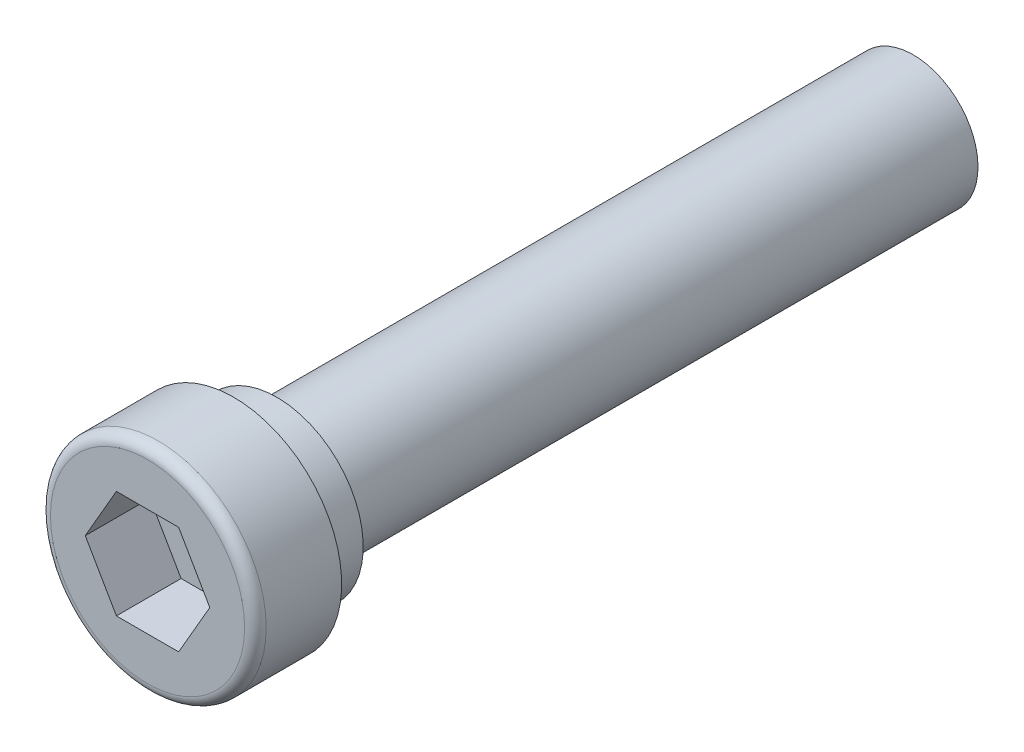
from build123d import *

# Parameters (mm, degrees)
SKIZZE1_W                       = 5
SKIZZE1_H                       = 6
SCHNITT_LINEAR_AUSTRAGEN1_DEPTH = 3.3
SKIZZE4_OUTSIDE_W               = 19.736
SKIZZE4_OUTSIDE_H               = 19.736
SKIZZE4_OUTSIDE_R               = 4
SCHNITT_LINEAR_AUSTRAGEN2_DEPTH = 2
VERRUNDUNG1_R                   = 0.5


with BuildPart() as part:
    # Skizze1 → Rotation1 (revolve)
    with BuildSketch(Plane.XZ, mode=Mode.PRIVATE) as rotation1_sk:
        with Locations((2.5, 3)):
            Rectangle(SKIZZE1_W, SKIZZE1_H)
    revolve(rotation1_sk.sketch.rotate(Axis((0, 0, 0), (0, 0, 1)), 180), axis=Axis((0, 0, 0), (0, 0, 1)))

    # Skizze2 → Schnitt-Linear austragen1 (cut)
    with BuildSketch(Plane.XY.offset(3)):
        Polygon((2.886751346, 0), (1.443375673, 2.5), (-1.443375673, 2.5), (-2.886751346, 0), (-1.443375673, -2.5), (1.443375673, -2.5), align=None)
    extrude(amount=SCHNITT_LINEAR_AUSTRAGEN1_DEPTH, mode=Mode.SUBTRACT)

    # Skizze3 → Rotation2 (revolve)
    with BuildSketch(Plane(origin=(0, 0, 0), x_dir=(0, 1, 0), z_dir=(-1, 0, 0)), mode=Mode.PRIVATE) as rotation2_sk:
        Polygon((0, 0), (0, 30), (2.133974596, 30), (3, 29.5), (3, 0), align=None)
    revolve(rotation2_sk.sketch.rotate(Axis((0, 0, 0), (0, 0, -1)), 90), axis=Axis((0, 0, 0), (0, 0, -1)))

    # Skizze4 outside → Schnitt-Linear austragen2 (cut)
    with BuildSketch(Plane(origin=(0, 0, 0), x_dir=(-1, 0, 0), z_dir=(0, 0, -1))):
        Rectangle(SKIZZE4_OUTSIDE_W, SKIZZE4_OUTSIDE_H)
        Circle(SKIZZE4_OUTSIDE_R, mode=Mode.SUBTRACT)
    extrude(amount=-SCHNITT_LINEAR_AUSTRAGEN2_DEPTH, mode=Mode.SUBTRACT)

    # Verrundung1
    verrundung1_edges = [part.edges().sort_by_distance(p)[0] for p in [
        (5, 0, 6),
    ]]
    fillet(verrundung1_edges, radius=VERRUNDUNG1_R)


solid = part.part
